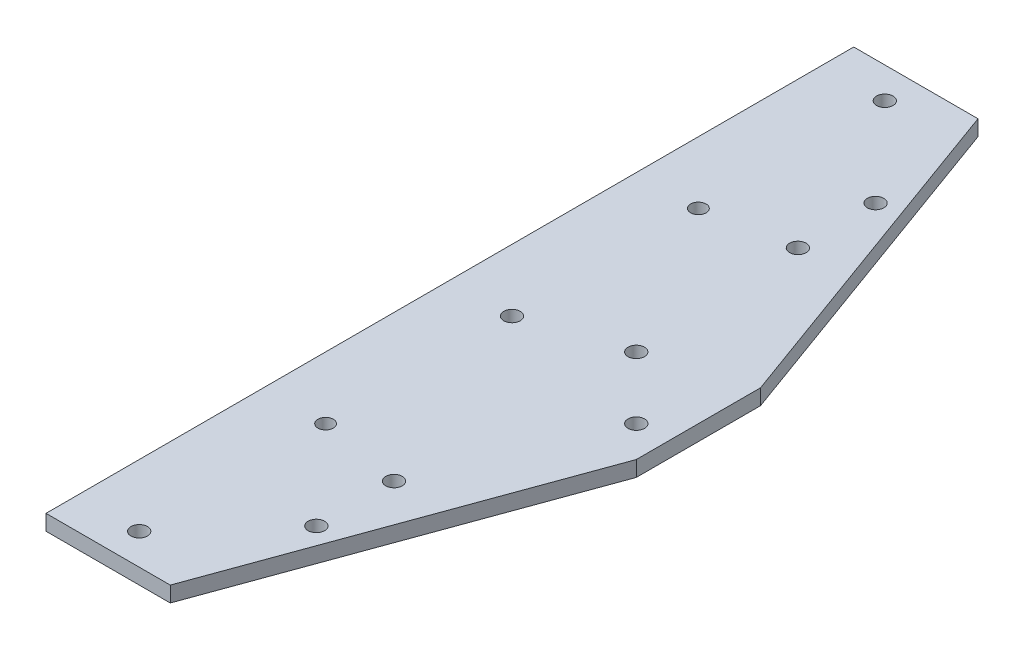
from build123d import *

# Parameters (mm, degrees)
SKETCH1_R      = 3.37312
EXTRUDE1_DEPTH = 6.35
SKETCH3_R      = 3.154378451
SKETCH3_R_2    = 3.37312
EXTRUDE3_DEPTH = 216.993362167


with BuildPart() as part:
    # Sketch1 → Extrude1 (new body)
    with BuildSketch(Plane(origin=(0, 0, 0), x_dir=(1, 0, 0), z_dir=(0, 1, 0))):
        Polygon((0, 0), (0, 50.8), (0, 190.5), (50.8, 190.5), (101.6, 50.8), (101.6, 0), (50.8, -139.7), (0, -139.7), (0, -18.472727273), align=None)
        with Locations(Location((88.9, 12.701075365, 0), (0, 0, 270))):
            Circle(SKETCH1_R, mode=Mode.SUBTRACT)
        with Locations(Location((63.5, 38.101075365, 0), (0, 0, 270))):
            Circle(SKETCH1_R, mode=Mode.SUBTRACT)
        with Locations(Location((25.4, 177.8, 0), (0, 0, 270))):
            Circle(SKETCH1_R, mode=Mode.SUBTRACT)
        with Locations(Location((25.4, -127, 0), (0, 0, 90))):
            Circle(SKETCH1_R, mode=Mode.SUBTRACT)
        with Locations(Location((25.4, 25.4, 0), (0, 0, 270))):
            Circle(SKETCH1_R, mode=Mode.SUBTRACT)
    extrude(amount=EXTRUDE1_DEPTH)

    # Sketch3 → Extrude3 (cut, through all)
    with BuildSketch(Plane(origin=(0, 6.35, 0), x_dir=(1, 0, 0), z_dir=(0, 1, 0))):
        with Locations(Location((25.4, 101.6, 0), (0, 0, 90))):
            Circle(SKETCH3_R)
        with Locations(Location((59.723220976, 107.95, 0), (0, 0, 270))):
            Circle(SKETCH3_R_2)
        with Locations(Location((59.723220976, 139.7, 0), (0, 0, 270))):
            Circle(SKETCH3_R_2)
        with Locations(Location((59.723220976, -88.9, 0), (0, 0, 90))):
            Circle(SKETCH3_R_2)
        with Locations(Location((25.4, -50.8, 0), (0, 0, 270))):
            Circle(SKETCH3_R)
        with Locations(Location((59.723220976, -57.15, 0), (0, 0, 90))):
            Circle(SKETCH3_R_2)
    extrude(amount=-EXTRUDE3_DEPTH, mode=Mode.SUBTRACT)


solid = part.part
